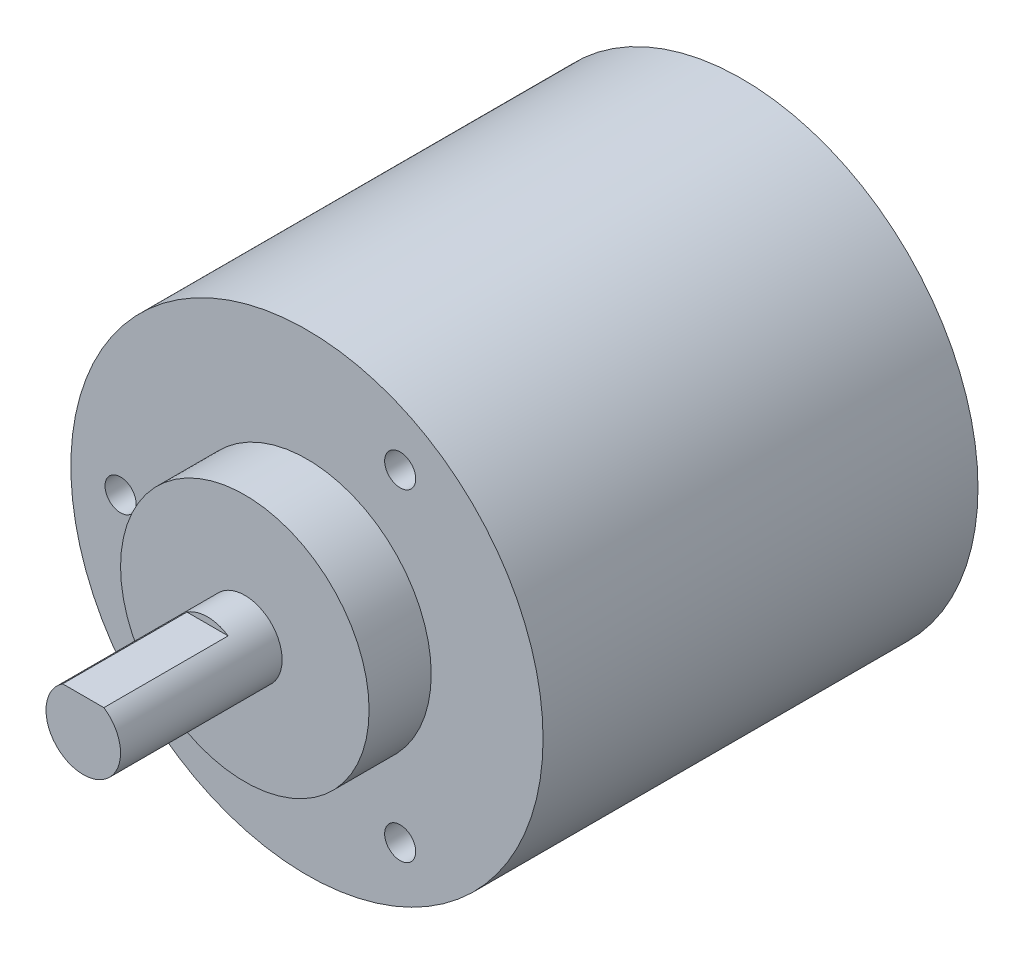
from build123d import *

# Parameters (mm, degrees)
SCHIZZO1_R                   = 19
ESTRUSIONE_ESTRUSIONE1_DEPTH = 35
SCHIZZO4_R                   = 10
ESTRUSIONE_ESTRUSIONE3_DEPTH = 5
SCHIZZO5_R                   = 3
ESTRUSIONE_ESTRUSIONE4_DEPTH = 13
SCHIZZO7_W                   = 6
SCHIZZO7_H                   = 1
TAGLIO_ESTRUSIONE1_DEPTH     = 10
FORO_FILETTATO_M3_1_D        = 2.5
FORO_FILETTATO_M3_1_DEPTH    = 8.5
FORO_FILETTATO_M3_1_TIP      = 0.751075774


with BuildPart() as part:
    # Schizzo1 → Estrusione-Estrusione1 (new body)
    with BuildSketch(Plane.XY):
        Circle(SCHIZZO1_R)
    extrude(amount=ESTRUSIONE_ESTRUSIONE1_DEPTH)

    # Schizzo4 → Estrusione-Estrusione3 (add)
    with BuildSketch(Plane.XY.offset(35)):
        Circle(SCHIZZO4_R)
    extrude(amount=ESTRUSIONE_ESTRUSIONE3_DEPTH)

    # Schizzo5 → Estrusione-Estrusione4 (add)
    with BuildSketch(Plane.XY.offset(40)):
        with Locations(Location((0, 0, 0), (0, 0, 180))):
            Circle(SCHIZZO5_R)
    extrude(amount=ESTRUSIONE_ESTRUSIONE4_DEPTH)

    # Schizzo7 → Taglio-Estrusione1 (cut)
    with BuildSketch(Plane.XY.offset(53)):
        with Locations((0, 3)):
            Rectangle(SCHIZZO7_W, SCHIZZO7_H)
    extrude(amount=-TAGLIO_ESTRUSIONE1_DEPTH, mode=Mode.SUBTRACT)

    # Foro filettato M3-1
    with Locations(Plane.XY.offset(35)):
        with Locations((7.5, 12.990381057), (7.5, -12.990381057), (-15, 0)):
            Hole(FORO_FILETTATO_M3_1_D / 2, depth=FORO_FILETTATO_M3_1_DEPTH)
            with Locations((0, 0, -(FORO_FILETTATO_M3_1_DEPTH + FORO_FILETTATO_M3_1_TIP / 2))):  # 118° drill point
                Cone(0, FORO_FILETTATO_M3_1_D / 2, FORO_FILETTATO_M3_1_TIP, mode=Mode.SUBTRACT)


solid = part.part
